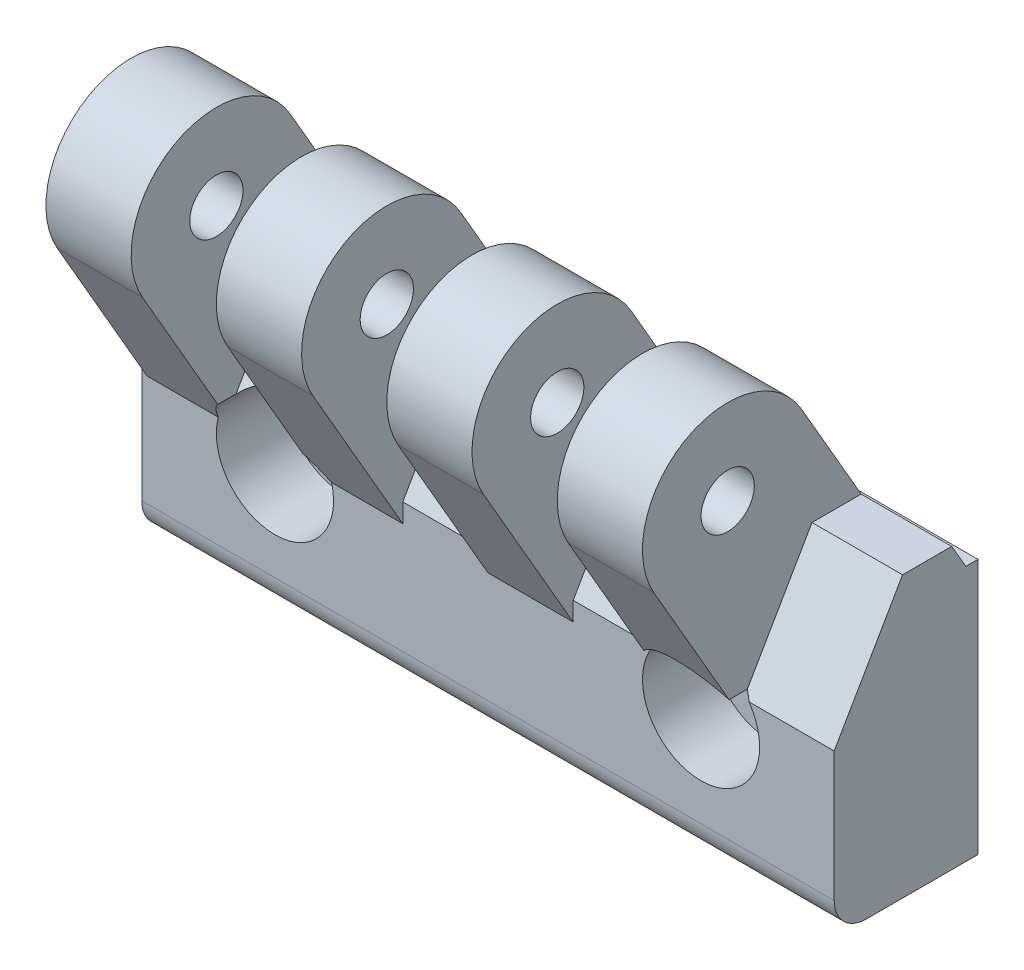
ISO-10303-21;
HEADER;
FILE_DESCRIPTION(('STEP AP214'),'2;1');
FILE_NAME('part.step','',(''),(''),'','','');
FILE_SCHEMA(('AUTOMOTIVE_DESIGN { 1 0 10303 214 1 1 1 1 }'));
ENDSEC;
DATA;
#1=APPLICATION_CONTEXT('core data for automotive mechanical design processes');
#2=APPLICATION_PROTOCOL_DEFINITION('international standard','automotive_design',2000,#1);
#3=PRODUCT_CONTEXT('',#1,'mechanical');
#4=PRODUCT('Part','Part','',(#3));
#5=PRODUCT_RELATED_PRODUCT_CATEGORY('part','',(#4));
#6=PRODUCT_DEFINITION_FORMATION('','',#4);
#7=PRODUCT_DEFINITION_CONTEXT('part definition',#1,'design');
#8=PRODUCT_DEFINITION('design','',#6,#7);
#9=PRODUCT_DEFINITION_SHAPE('','',#8);
#10=(LENGTH_UNIT() NAMED_UNIT(*) SI_UNIT(.MILLI.,.METRE.));
#11=(NAMED_UNIT(*) PLANE_ANGLE_UNIT() SI_UNIT($,.RADIAN.));
#12=(NAMED_UNIT(*) SI_UNIT($,.STERADIAN.) SOLID_ANGLE_UNIT());
#13=UNCERTAINTY_MEASURE_WITH_UNIT(LENGTH_MEASURE(1.E-05),#10,'distance_accuracy_value','');
#14=(GEOMETRIC_REPRESENTATION_CONTEXT(3) GLOBAL_UNCERTAINTY_ASSIGNED_CONTEXT((#13)) GLOBAL_UNIT_ASSIGNED_CONTEXT((#10,
#11,#12)) REPRESENTATION_CONTEXT('',''));
#15=CARTESIAN_POINT('',(0.,0.,0.));
#16=DIRECTION('',(0.,0.,1.));
#17=DIRECTION('',(1.,0.,0.));
#18=AXIS2_PLACEMENT_3D('',#15,#16,#17);
#19=CARTESIAN_POINT('',(4.,19.9999998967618,14.9999999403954));
#20=DIRECTION('',(1.,0.,0.));
#21=DIRECTION('',(0.,1.,0.));
#22=AXIS2_PLACEMENT_3D('',#19,#20,#21);
#23=PLANE('',#22);
#24=CARTESIAN_POINT('',(4.,20.,15.));
#25=DIRECTION('',(1.,0.,0.));
#26=DIRECTION('',(0.,1.,0.));
#27=AXIS2_PLACEMENT_3D('',#24,#25,#26);
#28=CIRCLE('',#27,2.5);
#29=CARTESIAN_POINT('',(4.,22.5,15.));
#30=VERTEX_POINT('',#29);
#31=EDGE_CURVE('E288',#30,#30,#28,.T.);
#32=ORIENTED_EDGE('',*,*,#31,.T.);
#33=EDGE_LOOP('',(#32));
#34=FACE_BOUND('',#33,.T.);
#35=DIRECTION('',(0.,0.,-1.));
#36=VECTOR('',#35,1.);
#37=CARTESIAN_POINT('',(4.,3.7749172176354,0.));
#38=LINE('',#37,#36);
#39=CARTESIAN_POINT('',(4.,3.7749172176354,14.8700483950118));
#40=VERTEX_POINT('',#39);
#41=CARTESIAN_POINT('',(4.,3.77491721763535,13.1504649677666));
#42=VERTEX_POINT('',#41);
#43=EDGE_CURVE('E604',#40,#42,#38,.T.);
#44=ORIENTED_EDGE('',*,*,#43,.F.);
#45=DIRECTION('',(0.,-0.866025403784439,-0.5));
#46=VECTOR('',#45,1.);
#47=CARTESIAN_POINT('',(4.,16.,21.9282032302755));
#48=LINE('',#47,#46);
#49=CARTESIAN_POINT('',(4.,16.,21.9282032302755));
#50=VERTEX_POINT('',#49);
#51=EDGE_CURVE('E285',#50,#40,#48,.T.);
#52=ORIENTED_EDGE('',*,*,#51,.F.);
#53=CARTESIAN_POINT('',(4.,19.9999998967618,14.9999999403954));
#54=DIRECTION('',(1.,0.,0.));
#55=DIRECTION('',(0.,1.,0.));
#56=AXIS2_PLACEMENT_3D('',#53,#54,#55);
#57=CIRCLE('',#56,8.);
#58=CARTESIAN_POINT('',(4.,24.,8.07179676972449));
#59=VERTEX_POINT('',#58);
#60=EDGE_CURVE('E281',#59,#50,#57,.T.);
#61=ORIENTED_EDGE('',*,*,#60,.F.);
#62=DIRECTION('',(0.,0.866025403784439,0.5));
#63=VECTOR('',#62,1.);
#64=CARTESIAN_POINT('',(4.,11.7512886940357,1.));
#65=LINE('',#64,#63);
#66=CARTESIAN_POINT('',(4.,14.2857142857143,2.4632512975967));
#67=VERTEX_POINT('',#66);
#68=EDGE_CURVE('E279',#67,#59,#65,.T.);
#69=ORIENTED_EDGE('',*,*,#68,.F.);
#70=DIRECTION('',(0.,0.,1.));
#71=VECTOR('',#70,1.);
#72=CARTESIAN_POINT('',(4.,14.2857142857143,2.4632512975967));
#73=LINE('',#72,#71);
#74=CARTESIAN_POINT('',(4.,14.2857142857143,7.08205345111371));
#75=VERTEX_POINT('',#74);
#76=EDGE_CURVE('E313',#67,#75,#73,.T.);
#77=ORIENTED_EDGE('',*,*,#76,.T.);
#78=DIRECTION('',(0.,-0.866025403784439,0.5));
#79=VECTOR('',#78,1.);
#80=CARTESIAN_POINT('',(4.,14.2857142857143,7.08205345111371));
#81=LINE('',#80,#79);
#82=EDGE_CURVE('E310',#75,#42,#81,.T.);
#83=ORIENTED_EDGE('',*,*,#82,.T.);
#84=EDGE_LOOP('',(#44,#52,#61,#69,#77,#83));
#85=FACE_BOUND('',#84,.T.);
#86=ADVANCED_FACE('F14',(#34,#85),#23,.F.);
#87=CARTESIAN_POINT('',(-4.,19.9999998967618,14.9999999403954));
#88=DIRECTION('',(1.,0.,0.));
#89=DIRECTION('',(0.,1.,0.));
#90=AXIS2_PLACEMENT_3D('',#87,#88,#89);
#91=PLANE('',#90);
#92=CARTESIAN_POINT('',(-4.,20.,15.));
#93=DIRECTION('',(1.,0.,0.));
#94=DIRECTION('',(0.,1.,0.));
#95=AXIS2_PLACEMENT_3D('',#92,#93,#94);
#96=CIRCLE('',#95,2.5);
#97=CARTESIAN_POINT('',(-4.,22.5,15.));
#98=VERTEX_POINT('',#97);
#99=EDGE_CURVE('E251',#98,#98,#96,.T.);
#100=ORIENTED_EDGE('',*,*,#99,.F.);
#101=EDGE_LOOP('',(#100));
#102=FACE_BOUND('',#101,.T.);
#103=DIRECTION('',(0.,-0.866025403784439,-0.5));
#104=VECTOR('',#103,1.);
#105=CARTESIAN_POINT('',(-4.,16.,21.9282032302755));
#106=LINE('',#105,#104);
#107=CARTESIAN_POINT('',(-4.,16.,21.9282032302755));
#108=VERTEX_POINT('',#107);
#109=CARTESIAN_POINT('',(-4.,3.7749172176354,14.8700483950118));
#110=VERTEX_POINT('',#109);
#111=EDGE_CURVE('E242',#108,#110,#106,.T.);
#112=ORIENTED_EDGE('',*,*,#111,.T.);
#113=DIRECTION('',(0.,0.,-1.));
#114=VECTOR('',#113,1.);
#115=CARTESIAN_POINT('',(-4.,3.7749172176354,0.));
#116=LINE('',#115,#114);
#117=CARTESIAN_POINT('',(-4.,3.77491721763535,13.1504649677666));
#118=VERTEX_POINT('',#117);
#119=EDGE_CURVE('E9',#110,#118,#116,.T.);
#120=ORIENTED_EDGE('',*,*,#119,.T.);
#121=DIRECTION('',(0.,-0.866025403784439,0.5));
#122=VECTOR('',#121,1.);
#123=CARTESIAN_POINT('',(-4.,14.2857142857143,7.08205345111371));
#124=LINE('',#123,#122);
#125=CARTESIAN_POINT('',(-4.,14.2857142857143,7.08205345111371));
#126=VERTEX_POINT('',#125);
#127=EDGE_CURVE('E266',#126,#118,#124,.T.);
#128=ORIENTED_EDGE('',*,*,#127,.F.);
#129=DIRECTION('',(0.,0.,1.));
#130=VECTOR('',#129,1.);
#131=CARTESIAN_POINT('',(-4.,14.2857142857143,2.4632512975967));
#132=LINE('',#131,#130);
#133=CARTESIAN_POINT('',(-4.,14.2857142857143,2.4632512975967));
#134=VERTEX_POINT('',#133);
#135=EDGE_CURVE('E268',#134,#126,#132,.T.);
#136=ORIENTED_EDGE('',*,*,#135,.F.);
#137=DIRECTION('',(0.,0.866025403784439,0.5));
#138=VECTOR('',#137,1.);
#139=CARTESIAN_POINT('',(-4.,11.7512886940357,1.));
#140=LINE('',#139,#138);
#141=CARTESIAN_POINT('',(-4.,24.,8.07179676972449));
#142=VERTEX_POINT('',#141);
#143=EDGE_CURVE('E256',#134,#142,#140,.T.);
#144=ORIENTED_EDGE('',*,*,#143,.T.);
#145=CARTESIAN_POINT('',(-4.,19.9999998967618,14.9999999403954));
#146=DIRECTION('',(1.,0.,0.));
#147=DIRECTION('',(0.,1.,0.));
#148=AXIS2_PLACEMENT_3D('',#145,#146,#147);
#149=CIRCLE('',#148,8.);
#150=EDGE_CURVE('E250',#142,#108,#149,.T.);
#151=ORIENTED_EDGE('',*,*,#150,.T.);
#152=EDGE_LOOP('',(#112,#120,#128,#136,#144,#151));
#153=FACE_BOUND('',#152,.T.);
#154=ADVANCED_FACE('F248',(#102,#153),#91,.T.);
#155=CARTESIAN_POINT('',(44.,19.9999998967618,14.9999999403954));
#156=DIRECTION('',(1.,0.,0.));
#157=DIRECTION('',(0.,1.,0.));
#158=AXIS2_PLACEMENT_3D('',#155,#156,#157);
#159=PLANE('',#158);
#160=CARTESIAN_POINT('',(44.,20.,15.));
#161=DIRECTION('',(1.,0.,0.));
#162=DIRECTION('',(0.,1.,0.));
#163=AXIS2_PLACEMENT_3D('',#160,#161,#162);
#164=CIRCLE('',#163,2.5);
#165=CARTESIAN_POINT('',(44.,22.5,15.));
#166=VERTEX_POINT('',#165);
#167=EDGE_CURVE('E569',#166,#166,#164,.T.);
#168=ORIENTED_EDGE('',*,*,#167,.F.);
#169=EDGE_LOOP('',(#168));
#170=FACE_BOUND('',#169,.T.);
#171=DIRECTION('',(0.,-0.866025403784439,-0.5));
#172=VECTOR('',#171,1.);
#173=CARTESIAN_POINT('',(44.,16.,21.9282032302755));
#174=LINE('',#173,#172);
#175=CARTESIAN_POINT('',(44.,16.,21.9282032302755));
#176=VERTEX_POINT('',#175);
#177=CARTESIAN_POINT('',(44.,3.77491721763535,14.8700483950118));
#178=VERTEX_POINT('',#177);
#179=EDGE_CURVE('E566',#176,#178,#174,.T.);
#180=ORIENTED_EDGE('',*,*,#179,.T.);
#181=DIRECTION('',(0.,0.,-1.));
#182=VECTOR('',#181,1.);
#183=CARTESIAN_POINT('',(44.,3.77491721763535,0.));
#184=LINE('',#183,#182);
#185=CARTESIAN_POINT('',(44.,3.77491721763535,13.1504649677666));
#186=VERTEX_POINT('',#185);
#187=EDGE_CURVE('E453',#178,#186,#184,.T.);
#188=ORIENTED_EDGE('',*,*,#187,.T.);
#189=DIRECTION('',(0.,-0.866025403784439,0.5));
#190=VECTOR('',#189,1.);
#191=CARTESIAN_POINT('',(44.,14.2857142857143,7.08205345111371));
#192=LINE('',#191,#190);
#193=CARTESIAN_POINT('',(44.,14.2857142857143,7.08205345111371));
#194=VERTEX_POINT('',#193);
#195=EDGE_CURVE('E440',#194,#186,#192,.T.);
#196=ORIENTED_EDGE('',*,*,#195,.F.);
#197=DIRECTION('',(0.,0.,1.));
#198=VECTOR('',#197,1.);
#199=CARTESIAN_POINT('',(44.,14.2857142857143,2.4632512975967));
#200=LINE('',#199,#198);
#201=CARTESIAN_POINT('',(44.,14.2857142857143,2.4632512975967));
#202=VERTEX_POINT('',#201);
#203=EDGE_CURVE('E463',#202,#194,#200,.T.);
#204=ORIENTED_EDGE('',*,*,#203,.F.);
#205=DIRECTION('',(0.,0.866025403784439,0.5));
#206=VECTOR('',#205,1.);
#207=CARTESIAN_POINT('',(44.,11.7512886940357,1.));
#208=LINE('',#207,#206);
#209=CARTESIAN_POINT('',(44.,24.,8.07179676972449));
#210=VERTEX_POINT('',#209);
#211=EDGE_CURVE('E561',#202,#210,#208,.T.);
#212=ORIENTED_EDGE('',*,*,#211,.T.);
#213=CARTESIAN_POINT('',(44.,19.9999998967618,14.9999999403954));
#214=DIRECTION('',(1.,0.,0.));
#215=DIRECTION('',(0.,1.,0.));
#216=AXIS2_PLACEMENT_3D('',#213,#214,#215);
#217=CIRCLE('',#216,8.);
#218=EDGE_CURVE('E563',#210,#176,#217,.T.);
#219=ORIENTED_EDGE('',*,*,#218,.T.);
#220=EDGE_LOOP('',(#180,#188,#196,#204,#212,#219));
#221=FACE_BOUND('',#220,.T.);
#222=ADVANCED_FACE('F637',(#170,#221),#159,.T.);
#223=CARTESIAN_POINT('',(36.,19.9999998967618,14.9999999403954));
#224=DIRECTION('',(1.,0.,0.));
#225=DIRECTION('',(0.,1.,0.));
#226=AXIS2_PLACEMENT_3D('',#223,#224,#225);
#227=PLANE('',#226);
#228=CARTESIAN_POINT('',(36.,20.,15.));
#229=DIRECTION('',(1.,0.,0.));
#230=DIRECTION('',(0.,1.,0.));
#231=AXIS2_PLACEMENT_3D('',#228,#229,#230);
#232=CIRCLE('',#231,2.5);
#233=CARTESIAN_POINT('',(36.,22.5,15.));
#234=VERTEX_POINT('',#233);
#235=EDGE_CURVE('E564',#234,#234,#232,.T.);
#236=ORIENTED_EDGE('',*,*,#235,.T.);
#237=EDGE_LOOP('',(#236));
#238=FACE_BOUND('',#237,.T.);
#239=DIRECTION('',(0.,0.,-1.));
#240=VECTOR('',#239,1.);
#241=CARTESIAN_POINT('',(36.,3.77491721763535,0.));
#242=LINE('',#241,#240);
#243=CARTESIAN_POINT('',(36.,3.77491721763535,14.8700483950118));
#244=VERTEX_POINT('',#243);
#245=CARTESIAN_POINT('',(36.,3.77491721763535,13.1504649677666));
#246=VERTEX_POINT('',#245);
#247=EDGE_CURVE('E22',#244,#246,#242,.T.);
#248=ORIENTED_EDGE('',*,*,#247,.F.);
#249=DIRECTION('',(0.,-0.866025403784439,-0.5));
#250=VECTOR('',#249,1.);
#251=CARTESIAN_POINT('',(36.,16.,21.9282032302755));
#252=LINE('',#251,#250);
#253=CARTESIAN_POINT('',(36.,16.,21.9282032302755));
#254=VERTEX_POINT('',#253);
#255=EDGE_CURVE('E575',#254,#244,#252,.T.);
#256=ORIENTED_EDGE('',*,*,#255,.F.);
#257=CARTESIAN_POINT('',(36.,19.9999998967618,14.9999999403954));
#258=DIRECTION('',(1.,0.,0.));
#259=DIRECTION('',(0.,1.,0.));
#260=AXIS2_PLACEMENT_3D('',#257,#258,#259);
#261=CIRCLE('',#260,8.);
#262=CARTESIAN_POINT('',(36.,24.,8.07179676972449));
#263=VERTEX_POINT('',#262);
#264=EDGE_CURVE('E573',#263,#254,#261,.T.);
#265=ORIENTED_EDGE('',*,*,#264,.F.);
#266=DIRECTION('',(0.,0.866025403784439,0.5));
#267=VECTOR('',#266,1.);
#268=CARTESIAN_POINT('',(36.,11.7512886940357,1.));
#269=LINE('',#268,#267);
#270=CARTESIAN_POINT('',(36.,14.2857142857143,2.4632512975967));
#271=VERTEX_POINT('',#270);
#272=EDGE_CURVE('E460',#271,#263,#269,.T.);
#273=ORIENTED_EDGE('',*,*,#272,.F.);
#274=DIRECTION('',(0.,0.,1.));
#275=VECTOR('',#274,1.);
#276=CARTESIAN_POINT('',(36.,14.2857142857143,2.4632512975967));
#277=LINE('',#276,#275);
#278=CARTESIAN_POINT('',(36.,14.2857142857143,7.08205345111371));
#279=VERTEX_POINT('',#278);
#280=EDGE_CURVE('E458',#271,#279,#277,.T.);
#281=ORIENTED_EDGE('',*,*,#280,.T.);
#282=DIRECTION('',(0.,-0.866025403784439,0.5));
#283=VECTOR('',#282,1.);
#284=CARTESIAN_POINT('',(36.,14.2857142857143,7.08205345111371));
#285=LINE('',#284,#283);
#286=EDGE_CURVE('E437',#279,#246,#285,.T.);
#287=ORIENTED_EDGE('',*,*,#286,.T.);
#288=EDGE_LOOP('',(#248,#256,#265,#273,#281,#287));
#289=FACE_BOUND('',#288,.T.);
#290=ADVANCED_FACE('F456',(#238,#289),#227,.F.);
#291=CARTESIAN_POINT('',(52.5,14.2857142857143,2.4632512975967));
#292=DIRECTION('',(0.,-1.,0.));
#293=DIRECTION('',(1.,0.,0.));
#294=AXIS2_PLACEMENT_3D('',#291,#292,#293);
#295=PLANE('',#294);
#296=ORIENTED_EDGE('',*,*,#280,.F.);
#297=DIRECTION('',(-1.,0.,0.));
#298=VECTOR('',#297,1.);
#299=CARTESIAN_POINT('',(52.5,14.2857142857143,2.4632512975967));
#300=LINE('',#299,#298);
#301=CARTESIAN_POINT('',(28.,14.2857142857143,2.4632512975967));
#302=VERTEX_POINT('',#301);
#303=EDGE_CURVE('E410',#271,#302,#300,.T.);
#304=ORIENTED_EDGE('',*,*,#303,.T.);
#305=DIRECTION('',(0.,0.,1.));
#306=VECTOR('',#305,1.);
#307=CARTESIAN_POINT('',(28.,14.2857142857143,2.4632512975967));
#308=LINE('',#307,#306);
#309=CARTESIAN_POINT('',(28.,14.2857142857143,7.08205345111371));
#310=VERTEX_POINT('',#309);
#311=EDGE_CURVE('E350',#302,#310,#308,.T.);
#312=ORIENTED_EDGE('',*,*,#311,.T.);
#313=DIRECTION('',(-1.,0.,0.));
#314=VECTOR('',#313,1.);
#315=CARTESIAN_POINT('',(52.5,14.2857142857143,7.08205345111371));
#316=LINE('',#315,#314);
#317=EDGE_CURVE('E405',#279,#310,#316,.T.);
#318=ORIENTED_EDGE('',*,*,#317,.F.);
#319=EDGE_LOOP('',(#296,#304,#312,#318));
#320=FACE_BOUND('',#319,.T.);
#321=ADVANCED_FACE('F675',(#320),#295,.F.);
#322=CARTESIAN_POINT('',(52.5,14.2857142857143,7.08205345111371));
#323=DIRECTION('',(0.,-0.5,-0.866025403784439));
#324=DIRECTION('',(0.,0.866025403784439,-0.5));
#325=AXIS2_PLACEMENT_3D('',#322,#323,#324);
#326=PLANE('',#325);
#327=CARTESIAN_POINT('',(40.,0.,15.3299144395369));
#328=DIRECTION('',(0.,-0.5,-0.866025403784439));
#329=DIRECTION('',(0.,0.866025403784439,-0.5));
#330=AXIS2_PLACEMENT_3D('',#327,#328,#329);
#331=ELLIPSE('',#330,6.35085296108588,5.5);
#332=CARTESIAN_POINT('',(35.5050873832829,3.1695047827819,13.5));
#333=VERTEX_POINT('',#332);
#334=EDGE_CURVE('E445',#246,#333,#331,.F.);
#335=ORIENTED_EDGE('',*,*,#334,.F.);
#336=ORIENTED_EDGE('',*,*,#286,.F.);
#337=ORIENTED_EDGE('',*,*,#317,.T.);
#338=DIRECTION('',(0.,-0.866025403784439,0.5));
#339=VECTOR('',#338,1.);
#340=CARTESIAN_POINT('',(28.,14.2857142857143,7.08205345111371));
#341=LINE('',#340,#339);
#342=CARTESIAN_POINT('',(28.,3.1695047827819,13.5));
#343=VERTEX_POINT('',#342);
#344=EDGE_CURVE('E347',#310,#343,#341,.T.);
#345=ORIENTED_EDGE('',*,*,#344,.T.);
#346=DIRECTION('',(-1.,0.,0.));
#347=VECTOR('',#346,1.);
#348=CARTESIAN_POINT('',(52.5,3.1695047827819,13.5));
#349=LINE('',#348,#347);
#350=EDGE_CURVE('E399',#333,#343,#349,.T.);
#351=ORIENTED_EDGE('',*,*,#350,.F.);
#352=EDGE_LOOP('',(#335,#336,#337,#345,#351));
#353=FACE_BOUND('',#352,.T.);
#354=ADVANCED_FACE('F451',(#353),#326,.F.);
#355=DIRECTION('',(0.,0.,1.));
#356=VECTOR('',#355,1.);
#357=CARTESIAN_POINT('',(-12.,14.2857142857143,2.4632512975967));
#358=LINE('',#357,#356);
#359=CARTESIAN_POINT('',(-12.,14.2857142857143,2.4632512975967));
#360=VERTEX_POINT('',#359);
#361=CARTESIAN_POINT('',(-12.,14.2857142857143,7.08205345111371));
#362=VERTEX_POINT('',#361);
#363=EDGE_CURVE('E276',#360,#362,#358,.T.);
#364=ORIENTED_EDGE('',*,*,#363,.F.);
#365=CARTESIAN_POINT('',(-12.5,14.2857142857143,2.4632512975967));
#366=VERTEX_POINT('',#365);
#367=EDGE_CURVE('E404',#360,#366,#300,.T.);
#368=ORIENTED_EDGE('',*,*,#367,.T.);
#369=DIRECTION('',(0.,0.,1.));
#370=VECTOR('',#369,1.);
#371=CARTESIAN_POINT('',(-12.5,14.2857142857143,2.4632512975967));
#372=LINE('',#371,#370);
#373=CARTESIAN_POINT('',(-12.5,14.2857142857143,7.08205345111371));
#374=VERTEX_POINT('',#373);
#375=EDGE_CURVE('E385',#366,#374,#372,.T.);
#376=ORIENTED_EDGE('',*,*,#375,.T.);
#377=EDGE_CURVE('E398',#362,#374,#316,.T.);
#378=ORIENTED_EDGE('',*,*,#377,.F.);
#379=EDGE_LOOP('',(#364,#368,#376,#378));
#380=FACE_BOUND('',#379,.T.);
#381=ADVANCED_FACE('F536',(#380),#295,.F.);
#382=DIRECTION('',(0.,-0.866025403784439,0.5));
#383=VECTOR('',#382,1.);
#384=CARTESIAN_POINT('',(-12.,14.2857142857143,7.08205345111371));
#385=LINE('',#384,#383);
#386=CARTESIAN_POINT('',(-12.,3.1695047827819,13.5));
#387=VERTEX_POINT('',#386);
#388=EDGE_CURVE('E274',#362,#387,#385,.T.);
#389=ORIENTED_EDGE('',*,*,#388,.F.);
#390=ORIENTED_EDGE('',*,*,#377,.T.);
#391=DIRECTION('',(0.,-0.866025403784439,0.5));
#392=VECTOR('',#391,1.);
#393=CARTESIAN_POINT('',(-12.5,14.2857142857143,7.08205345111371));
#394=LINE('',#393,#392);
#395=CARTESIAN_POINT('',(-12.5,3.1695047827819,13.5));
#396=VERTEX_POINT('',#395);
#397=EDGE_CURVE('E388',#374,#396,#394,.T.);
#398=ORIENTED_EDGE('',*,*,#397,.T.);
#399=EDGE_CURVE('E394',#387,#396,#349,.T.);
#400=ORIENTED_EDGE('',*,*,#399,.F.);
#401=EDGE_LOOP('',(#389,#390,#398,#400));
#402=FACE_BOUND('',#401,.T.);
#403=ADVANCED_FACE('F498',(#402),#326,.F.);
#404=CARTESIAN_POINT('',(52.5,3.1695047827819,13.5));
#405=DIRECTION('',(0.,0.,-1.));
#406=DIRECTION('',(-1.,0.,0.));
#407=AXIS2_PLACEMENT_3D('',#404,#405,#406);
#408=PLANE('',#407);
#409=DIRECTION('',(-1.,0.,0.));
#410=VECTOR('',#409,1.);
#411=CARTESIAN_POINT('',(52.5,1.4019237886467,13.5));
#412=LINE('',#411,#410);
#413=CARTESIAN_POINT('',(12.,1.4019237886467,13.5));
#414=VERTEX_POINT('',#413);
#415=CARTESIAN_POINT('',(5.3183277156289,1.4019237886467,13.5));
#416=VERTEX_POINT('',#415);
#417=EDGE_CURVE('E433',#414,#416,#412,.T.);
#418=ORIENTED_EDGE('',*,*,#417,.T.);
#419=CARTESIAN_POINT('',(0.,0.,13.5));
#420=DIRECTION('',(0.,0.,-1.));
#421=DIRECTION('',(-1.,0.,0.));
#422=AXIS2_PLACEMENT_3D('',#419,#420,#421);
#423=CIRCLE('',#422,5.5);
#424=CARTESIAN_POINT('',(-5.3183277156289,1.4019237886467,13.5));
#425=VERTEX_POINT('',#424);
#426=EDGE_CURVE('E717',#425,#416,#423,.F.);
#427=ORIENTED_EDGE('',*,*,#426,.F.);
#428=DIRECTION('',(-1.,0.,0.));
#429=VECTOR('',#428,1.);
#430=CARTESIAN_POINT('',(52.5,1.4019237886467,13.5));
#431=LINE('',#430,#429);
#432=CARTESIAN_POINT('',(-12.,1.4019237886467,13.5));
#433=VERTEX_POINT('',#432);
#434=EDGE_CURVE('E245',#425,#433,#431,.T.);
#435=ORIENTED_EDGE('',*,*,#434,.T.);
#436=DIRECTION('',(0.,-1.,0.));
#437=VECTOR('',#436,1.);
#438=CARTESIAN_POINT('',(-12.,3.1695047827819,13.5));
#439=LINE('',#438,#437);
#440=EDGE_CURVE('E271',#387,#433,#439,.T.);
#441=ORIENTED_EDGE('',*,*,#440,.F.);
#442=ORIENTED_EDGE('',*,*,#399,.T.);
#443=DIRECTION('',(0.,-1.,0.));
#444=VECTOR('',#443,1.);
#445=CARTESIAN_POINT('',(-12.5,3.1695047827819,13.5));
#446=LINE('',#445,#444);
#447=CARTESIAN_POINT('',(-12.5,-9.,13.5));
#448=VERTEX_POINT('',#447);
#449=EDGE_CURVE('E358',#396,#448,#446,.T.);
#450=ORIENTED_EDGE('',*,*,#449,.T.);
#451=DIRECTION('',(-1.,0.,0.));
#452=VECTOR('',#451,1.);
#453=CARTESIAN_POINT('',(52.5,-9.,13.5));
#454=LINE('',#453,#452);
#455=CARTESIAN_POINT('',(52.5,-9.,13.5));
#456=VERTEX_POINT('',#455);
#457=EDGE_CURVE('E372',#456,#448,#454,.T.);
#458=ORIENTED_EDGE('',*,*,#457,.F.);
#459=DIRECTION('',(0.,-1.,0.));
#460=VECTOR('',#459,1.);
#461=CARTESIAN_POINT('',(52.5,3.1695047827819,13.5));
#462=LINE('',#461,#460);
#463=CARTESIAN_POINT('',(52.5,3.1695047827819,13.5));
#464=VERTEX_POINT('',#463);
#465=EDGE_CURVE('E370',#464,#456,#462,.T.);
#466=ORIENTED_EDGE('',*,*,#465,.F.);
#467=CARTESIAN_POINT('',(44.4949126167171,3.1695047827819,13.5));
#468=VERTEX_POINT('',#467);
#469=EDGE_CURVE('E395',#464,#468,#349,.T.);
#470=ORIENTED_EDGE('',*,*,#469,.T.);
#471=CARTESIAN_POINT('',(40.,0.,13.5));
#472=DIRECTION('',(0.,0.,-1.));
#473=DIRECTION('',(-1.,0.,0.));
#474=AXIS2_PLACEMENT_3D('',#471,#472,#473);
#475=CIRCLE('',#474,5.5);
#476=EDGE_CURVE('E504',#333,#468,#475,.F.);
#477=ORIENTED_EDGE('',*,*,#476,.F.);
#478=ORIENTED_EDGE('',*,*,#350,.T.);
#479=DIRECTION('',(0.,-1.,0.));
#480=VECTOR('',#479,1.);
#481=CARTESIAN_POINT('',(28.,3.1695047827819,13.5));
#482=LINE('',#481,#480);
#483=CARTESIAN_POINT('',(28.,1.4019237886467,13.5));
#484=VERTEX_POINT('',#483);
#485=EDGE_CURVE('E428',#343,#484,#482,.T.);
#486=ORIENTED_EDGE('',*,*,#485,.T.);
#487=DIRECTION('',(1.,0.,0.));
#488=VECTOR('',#487,1.);
#489=CARTESIAN_POINT('',(52.5,1.4019237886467,13.5));
#490=LINE('',#489,#488);
#491=CARTESIAN_POINT('',(20.,1.4019237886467,13.5));
#492=VERTEX_POINT('',#491);
#493=EDGE_CURVE('E425',#492,#484,#490,.T.);
#494=ORIENTED_EDGE('',*,*,#493,.F.);
#495=DIRECTION('',(0.,-1.,0.));
#496=VECTOR('',#495,1.);
#497=CARTESIAN_POINT('',(20.,3.1695047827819,13.5));
#498=LINE('',#497,#496);
#499=CARTESIAN_POINT('',(20.,3.1695047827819,13.5));
#500=VERTEX_POINT('',#499);
#501=EDGE_CURVE('E422',#500,#492,#498,.T.);
#502=ORIENTED_EDGE('',*,*,#501,.F.);
#503=CARTESIAN_POINT('',(12.,3.1695047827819,13.5));
#504=VERTEX_POINT('',#503);
#505=EDGE_CURVE('E400',#500,#504,#349,.T.);
#506=ORIENTED_EDGE('',*,*,#505,.T.);
#507=DIRECTION('',(0.,-1.,0.));
#508=VECTOR('',#507,1.);
#509=CARTESIAN_POINT('',(12.,3.1695047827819,13.5));
#510=LINE('',#509,#508);
#511=EDGE_CURVE('E430',#504,#414,#510,.T.);
#512=ORIENTED_EDGE('',*,*,#511,.T.);
#513=EDGE_LOOP('',(#418,#427,#435,#441,#442,#450,#458,#466,#470,#477,#478,#486,#494,#502,#506,#512));
#514=FACE_BOUND('',#513,.T.);
#515=ADVANCED_FACE('F496',(#514),#408,.F.);
#516=EDGE_CURVE('E591',#67,#134,#300,.T.);
#517=ORIENTED_EDGE('',*,*,#516,.T.);
#518=ORIENTED_EDGE('',*,*,#135,.T.);
#519=EDGE_CURVE('E528',#75,#126,#316,.T.);
#520=ORIENTED_EDGE('',*,*,#519,.F.);
#521=ORIENTED_EDGE('',*,*,#76,.F.);
#522=EDGE_LOOP('',(#517,#518,#520,#521));
#523=FACE_BOUND('',#522,.T.);
#524=ADVANCED_FACE('F594',(#523),#295,.F.);
#525=CARTESIAN_POINT('',(0.,0.,15.3299144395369));
#526=DIRECTION('',(0.,-0.5,-0.866025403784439));
#527=DIRECTION('',(0.,0.866025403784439,-0.5));
#528=AXIS2_PLACEMENT_3D('',#525,#526,#527);
#529=ELLIPSE('',#528,6.35085296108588,5.5);
#530=EDGE_CURVE('E29',#42,#118,#529,.F.);
#531=ORIENTED_EDGE('',*,*,#530,.F.);
#532=ORIENTED_EDGE('',*,*,#82,.F.);
#533=ORIENTED_EDGE('',*,*,#519,.T.);
#534=ORIENTED_EDGE('',*,*,#127,.T.);
#535=EDGE_LOOP('',(#531,#532,#533,#534));
#536=FACE_BOUND('',#535,.T.);
#537=ADVANCED_FACE('F858',(#536),#326,.F.);
#538=CARTESIAN_POINT('',(20.,14.2857142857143,2.4632512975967));
#539=VERTEX_POINT('',#538);
#540=CARTESIAN_POINT('',(12.,14.2857142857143,2.4632512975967));
#541=VERTEX_POINT('',#540);
#542=EDGE_CURVE('E411',#539,#541,#300,.T.);
#543=ORIENTED_EDGE('',*,*,#542,.T.);
#544=DIRECTION('',(0.,0.,1.));
#545=VECTOR('',#544,1.);
#546=CARTESIAN_POINT('',(12.,14.2857142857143,2.4632512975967));
#547=LINE('',#546,#545);
#548=CARTESIAN_POINT('',(12.,14.2857142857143,7.08205345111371));
#549=VERTEX_POINT('',#548);
#550=EDGE_CURVE('E307',#541,#549,#547,.T.);
#551=ORIENTED_EDGE('',*,*,#550,.T.);
#552=CARTESIAN_POINT('',(20.,14.2857142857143,7.08205345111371));
#553=VERTEX_POINT('',#552);
#554=EDGE_CURVE('E406',#553,#549,#316,.T.);
#555=ORIENTED_EDGE('',*,*,#554,.F.);
#556=DIRECTION('',(0.,0.,1.));
#557=VECTOR('',#556,1.);
#558=CARTESIAN_POINT('',(20.,14.2857142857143,2.4632512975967));
#559=LINE('',#558,#557);
#560=EDGE_CURVE('E344',#539,#553,#559,.T.);
#561=ORIENTED_EDGE('',*,*,#560,.F.);
#562=EDGE_LOOP('',(#543,#551,#555,#561));
#563=FACE_BOUND('',#562,.T.);
#564=ADVANCED_FACE('F526',(#563),#295,.F.);
#565=ORIENTED_EDGE('',*,*,#554,.T.);
#566=DIRECTION('',(0.,-0.866025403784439,0.5));
#567=VECTOR('',#566,1.);
#568=CARTESIAN_POINT('',(12.,14.2857142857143,7.08205345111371));
#569=LINE('',#568,#567);
#570=EDGE_CURVE('E304',#549,#504,#569,.T.);
#571=ORIENTED_EDGE('',*,*,#570,.T.);
#572=ORIENTED_EDGE('',*,*,#505,.F.);
#573=DIRECTION('',(0.,-0.866025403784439,0.5));
#574=VECTOR('',#573,1.);
#575=CARTESIAN_POINT('',(20.,14.2857142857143,7.08205345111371));
#576=LINE('',#575,#574);
#577=EDGE_CURVE('E341',#553,#500,#576,.T.);
#578=ORIENTED_EDGE('',*,*,#577,.F.);
#579=EDGE_LOOP('',(#565,#571,#572,#578));
#580=FACE_BOUND('',#579,.T.);
#581=ADVANCED_FACE('F523',(#580),#326,.F.);
#582=CARTESIAN_POINT('',(52.5,-9.,10.5));
#583=DIRECTION('',(-1.,0.,0.));
#584=DIRECTION('',(0.,-1.,0.));
#585=AXIS2_PLACEMENT_3D('',#582,#583,#584);
#586=CYLINDRICAL_SURFACE('',#585,3.);
#587=CARTESIAN_POINT('',(-12.5,-9.,10.5));
#588=DIRECTION('',(1.,0.,0.));
#589=DIRECTION('',(0.,1.,0.));
#590=AXIS2_PLACEMENT_3D('',#587,#588,#589);
#591=CIRCLE('',#590,3.);
#592=CARTESIAN_POINT('',(-12.5,-12.,10.5));
#593=VERTEX_POINT('',#592);
#594=EDGE_CURVE('E353',#448,#593,#591,.T.);
#595=ORIENTED_EDGE('',*,*,#594,.T.);
#596=DIRECTION('',(-1.,0.,0.));
#597=VECTOR('',#596,1.);
#598=CARTESIAN_POINT('',(52.5,-12.,10.5));
#599=LINE('',#598,#597);
#600=CARTESIAN_POINT('',(52.5,-12.,10.5));
#601=VERTEX_POINT('',#600);
#602=EDGE_CURVE('E419',#601,#593,#599,.T.);
#603=ORIENTED_EDGE('',*,*,#602,.F.);
#604=CARTESIAN_POINT('',(52.5,-9.,10.5));
#605=DIRECTION('',(1.,0.,0.));
#606=DIRECTION('',(0.,1.,0.));
#607=AXIS2_PLACEMENT_3D('',#604,#605,#606);
#608=CIRCLE('',#607,3.);
#609=EDGE_CURVE('E354',#456,#601,#608,.T.);
#610=ORIENTED_EDGE('',*,*,#609,.F.);
#611=ORIENTED_EDGE('',*,*,#457,.T.);
#612=EDGE_LOOP('',(#595,#603,#610,#611));
#613=FACE_BOUND('',#612,.T.);
#614=ADVANCED_FACE('F16',(#613),#586,.T.);
#615=CARTESIAN_POINT('',(52.5,-12.,10.5));
#616=DIRECTION('',(0.,1.,0.));
#617=DIRECTION('',(-1.,0.,0.));
#618=AXIS2_PLACEMENT_3D('',#615,#616,#617);
#619=PLANE('',#618);
#620=DIRECTION('',(0.,0.,-1.));
#621=VECTOR('',#620,1.);
#622=CARTESIAN_POINT('',(-12.5,-12.,10.5));
#623=LINE('',#622,#621);
#624=CARTESIAN_POINT('',(-12.5,-12.,0.));
#625=VERTEX_POINT('',#624);
#626=EDGE_CURVE('E375',#593,#625,#623,.T.);
#627=ORIENTED_EDGE('',*,*,#626,.T.);
#628=DIRECTION('',(-1.,0.,0.));
#629=VECTOR('',#628,1.);
#630=CARTESIAN_POINT('',(52.5,-12.,0.));
#631=LINE('',#630,#629);
#632=CARTESIAN_POINT('',(52.5,-12.,0.));
#633=VERTEX_POINT('',#632);
#634=EDGE_CURVE('E416',#633,#625,#631,.T.);
#635=ORIENTED_EDGE('',*,*,#634,.F.);
#636=DIRECTION('',(0.,0.,-1.));
#637=VECTOR('',#636,1.);
#638=CARTESIAN_POINT('',(52.5,-12.,10.5));
#639=LINE('',#638,#637);
#640=EDGE_CURVE('E357',#601,#633,#639,.T.);
#641=ORIENTED_EDGE('',*,*,#640,.F.);
#642=ORIENTED_EDGE('',*,*,#602,.T.);
#643=EDGE_LOOP('',(#627,#635,#641,#642));
#644=FACE_BOUND('',#643,.T.);
#645=ADVANCED_FACE('F684',(#644),#619,.F.);
#646=CARTESIAN_POINT('',(52.5,-12.,0.));
#647=DIRECTION('',(0.,0.,1.));
#648=DIRECTION('',(1.,0.,0.));
#649=AXIS2_PLACEMENT_3D('',#646,#647,#648);
#650=PLANE('',#649);
#651=CARTESIAN_POINT('',(0.,0.,0.));
#652=DIRECTION('',(0.,0.,-1.));
#653=DIRECTION('',(-1.,0.,0.));
#654=AXIS2_PLACEMENT_3D('',#651,#652,#653);
#655=CIRCLE('',#654,3.25);
#656=CARTESIAN_POINT('',(-3.25,0.,0.));
#657=VERTEX_POINT('',#656);
#658=EDGE_CURVE('E725',#657,#657,#655,.T.);
#659=ORIENTED_EDGE('',*,*,#658,.F.);
#660=EDGE_LOOP('',(#659));
#661=FACE_BOUND('',#660,.T.);
#662=CARTESIAN_POINT('',(40.,0.,0.));
#663=DIRECTION('',(0.,0.,-1.));
#664=DIRECTION('',(-1.,0.,0.));
#665=AXIS2_PLACEMENT_3D('',#662,#663,#664);
#666=CIRCLE('',#665,3.25);
#667=CARTESIAN_POINT('',(36.75,0.,0.));
#668=VERTEX_POINT('',#667);
#669=EDGE_CURVE('E712',#668,#668,#666,.T.);
#670=ORIENTED_EDGE('',*,*,#669,.F.);
#671=EDGE_LOOP('',(#670));
#672=FACE_BOUND('',#671,.T.);
#673=DIRECTION('',(0.,1.,0.));
#674=VECTOR('',#673,1.);
#675=CARTESIAN_POINT('',(-12.5,-12.,0.));
#676=LINE('',#675,#674);
#677=CARTESIAN_POINT('',(-12.5,12.,0.));
#678=VERTEX_POINT('',#677);
#679=EDGE_CURVE('E377',#625,#678,#676,.T.);
#680=ORIENTED_EDGE('',*,*,#679,.T.);
#681=DIRECTION('',(-1.,0.,0.));
#682=VECTOR('',#681,1.);
#683=CARTESIAN_POINT('',(52.5,12.,0.));
#684=LINE('',#683,#682);
#685=CARTESIAN_POINT('',(52.5,12.,0.));
#686=VERTEX_POINT('',#685);
#687=EDGE_CURVE('E413',#686,#678,#684,.T.);
#688=ORIENTED_EDGE('',*,*,#687,.F.);
#689=DIRECTION('',(0.,1.,0.));
#690=VECTOR('',#689,1.);
#691=CARTESIAN_POINT('',(52.5,-12.,0.));
#692=LINE('',#691,#690);
#693=EDGE_CURVE('E360',#633,#686,#692,.T.);
#694=ORIENTED_EDGE('',*,*,#693,.F.);
#695=ORIENTED_EDGE('',*,*,#634,.T.);
#696=EDGE_LOOP('',(#680,#688,#694,#695));
#697=FACE_BOUND('',#696,.T.);
#698=ADVANCED_FACE('F681',(#661,#672,#697),#650,.F.);
#699=CARTESIAN_POINT('',(52.5,12.,0.));
#700=DIRECTION('',(0.,-1.,0.));
#701=DIRECTION('',(1.,0.,0.));
#702=AXIS2_PLACEMENT_3D('',#699,#700,#701);
#703=PLANE('',#702);
#704=DIRECTION('',(0.,0.,1.));
#705=VECTOR('',#704,1.);
#706=CARTESIAN_POINT('',(-12.5,12.,0.));
#707=LINE('',#706,#705);
#708=CARTESIAN_POINT('',(-12.5,12.,1.14359353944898));
#709=VERTEX_POINT('',#708);
#710=EDGE_CURVE('E379',#678,#709,#707,.T.);
#711=ORIENTED_EDGE('',*,*,#710,.T.);
#712=DIRECTION('',(-1.,0.,0.));
#713=VECTOR('',#712,1.);
#714=CARTESIAN_POINT('',(52.5,12.,1.14359353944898));
#715=LINE('',#714,#713);
#716=CARTESIAN_POINT('',(52.5,12.,1.14359353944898));
#717=VERTEX_POINT('',#716);
#718=EDGE_CURVE('E409',#717,#709,#715,.T.);
#719=ORIENTED_EDGE('',*,*,#718,.F.);
#720=DIRECTION('',(0.,0.,1.));
#721=VECTOR('',#720,1.);
#722=CARTESIAN_POINT('',(52.5,12.,0.));
#723=LINE('',#722,#721);
#724=EDGE_CURVE('E362',#686,#717,#723,.T.);
#725=ORIENTED_EDGE('',*,*,#724,.F.);
#726=ORIENTED_EDGE('',*,*,#687,.T.);
#727=EDGE_LOOP('',(#711,#719,#725,#726));
#728=FACE_BOUND('',#727,.T.);
#729=ADVANCED_FACE('F678',(#728),#703,.F.);
#730=CARTESIAN_POINT('',(52.5,12.,1.14359353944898));
#731=DIRECTION('',(0.,-0.5,0.866025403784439));
#732=DIRECTION('',(0.,-0.866025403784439,-0.5));
#733=AXIS2_PLACEMENT_3D('',#730,#731,#732);
#734=PLANE('',#733);
#735=ORIENTED_EDGE('',*,*,#718,.T.);
#736=DIRECTION('',(0.,0.866025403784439,0.5));
#737=VECTOR('',#736,1.);
#738=CARTESIAN_POINT('',(-12.5,12.,1.14359353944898));
#739=LINE('',#738,#737);
#740=EDGE_CURVE('E382',#709,#366,#739,.T.);
#741=ORIENTED_EDGE('',*,*,#740,.T.);
#742=ORIENTED_EDGE('',*,*,#367,.F.);
#743=DIRECTION('',(0.,0.866025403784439,0.5));
#744=VECTOR('',#743,1.);
#745=CARTESIAN_POINT('',(-12.,11.7512886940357,1.));
#746=LINE('',#745,#744);
#747=CARTESIAN_POINT('',(-12.,24.,8.07179676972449));
#748=VERTEX_POINT('',#747);
#749=EDGE_CURVE('E254',#360,#748,#746,.T.);
#750=ORIENTED_EDGE('',*,*,#749,.T.);
#751=DIRECTION('',(1.,0.,0.));
#752=VECTOR('',#751,1.);
#753=CARTESIAN_POINT('',(-12.,24.,8.07179676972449));
#754=LINE('',#753,#752);
#755=EDGE_CURVE('E262',#748,#142,#754,.T.);
#756=ORIENTED_EDGE('',*,*,#755,.T.);
#757=ORIENTED_EDGE('',*,*,#143,.F.);
#758=ORIENTED_EDGE('',*,*,#516,.F.);
#759=ORIENTED_EDGE('',*,*,#68,.T.);
#760=DIRECTION('',(1.,0.,0.));
#761=VECTOR('',#760,1.);
#762=CARTESIAN_POINT('',(4.,24.,8.07179676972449));
#763=LINE('',#762,#761);
#764=CARTESIAN_POINT('',(12.,24.,8.07179676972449));
#765=VERTEX_POINT('',#764);
#766=EDGE_CURVE('E301',#59,#765,#763,.T.);
#767=ORIENTED_EDGE('',*,*,#766,.T.);
#768=DIRECTION('',(0.,0.866025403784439,0.5));
#769=VECTOR('',#768,1.);
#770=CARTESIAN_POINT('',(12.,11.7512886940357,1.));
#771=LINE('',#770,#769);
#772=EDGE_CURVE('E278',#541,#765,#771,.T.);
#773=ORIENTED_EDGE('',*,*,#772,.F.);
#774=ORIENTED_EDGE('',*,*,#542,.F.);
#775=DIRECTION('',(0.,0.866025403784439,0.5));
#776=VECTOR('',#775,1.);
#777=CARTESIAN_POINT('',(20.,11.7512886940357,1.));
#778=LINE('',#777,#776);
#779=CARTESIAN_POINT('',(20.,24.,8.07179676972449));
#780=VERTEX_POINT('',#779);
#781=EDGE_CURVE('E315',#539,#780,#778,.T.);
#782=ORIENTED_EDGE('',*,*,#781,.T.);
#783=DIRECTION('',(-1.,0.,0.));
#784=VECTOR('',#783,1.);
#785=CARTESIAN_POINT('',(28.,24.,8.07179676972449));
#786=LINE('',#785,#784);
#787=CARTESIAN_POINT('',(28.,24.,8.07179676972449));
#788=VERTEX_POINT('',#787);
#789=EDGE_CURVE('E338',#788,#780,#786,.T.);
#790=ORIENTED_EDGE('',*,*,#789,.F.);
#791=DIRECTION('',(0.,0.866025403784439,0.5));
#792=VECTOR('',#791,1.);
#793=CARTESIAN_POINT('',(28.,11.7512886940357,1.));
#794=LINE('',#793,#792);
#795=EDGE_CURVE('E316',#302,#788,#794,.T.);
#796=ORIENTED_EDGE('',*,*,#795,.F.);
#797=ORIENTED_EDGE('',*,*,#303,.F.);
#798=ORIENTED_EDGE('',*,*,#272,.T.);
#799=DIRECTION('',(-1.,0.,0.));
#800=VECTOR('',#799,1.);
#801=CARTESIAN_POINT('',(44.,24.,8.07179676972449));
#802=LINE('',#801,#800);
#803=EDGE_CURVE('E464',#210,#263,#802,.T.);
#804=ORIENTED_EDGE('',*,*,#803,.F.);
#805=ORIENTED_EDGE('',*,*,#211,.F.);
#806=CARTESIAN_POINT('',(52.5,14.2857142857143,2.4632512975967));
#807=VERTEX_POINT('',#806);
#808=EDGE_CURVE('E407',#807,#202,#300,.T.);
#809=ORIENTED_EDGE('',*,*,#808,.F.);
#810=DIRECTION('',(0.,0.866025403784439,0.5));
#811=VECTOR('',#810,1.);
#812=CARTESIAN_POINT('',(52.5,12.,1.14359353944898));
#813=LINE('',#812,#811);
#814=EDGE_CURVE('E364',#717,#807,#813,.T.);
#815=ORIENTED_EDGE('',*,*,#814,.F.);
#816=EDGE_LOOP('',(#735,#741,#742,#750,#756,#757,#758,#759,#767,#773,#774,#782,#790,#796,#797,
#798,#804,#805,#809,#815));
#817=FACE_BOUND('',#816,.T.);
#818=ADVANCED_FACE('F484',(#817),#734,.F.);
#819=ORIENTED_EDGE('',*,*,#808,.T.);
#820=ORIENTED_EDGE('',*,*,#203,.T.);
#821=CARTESIAN_POINT('',(52.5,14.2857142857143,7.08205345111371));
#822=VERTEX_POINT('',#821);
#823=EDGE_CURVE('E401',#822,#194,#316,.T.);
#824=ORIENTED_EDGE('',*,*,#823,.F.);
#825=DIRECTION('',(0.,0.,1.));
#826=VECTOR('',#825,1.);
#827=CARTESIAN_POINT('',(52.5,14.2857142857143,2.4632512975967));
#828=LINE('',#827,#826);
#829=EDGE_CURVE('E366',#807,#822,#828,.T.);
#830=ORIENTED_EDGE('',*,*,#829,.F.);
#831=EDGE_LOOP('',(#819,#820,#824,#830));
#832=FACE_BOUND('',#831,.T.);
#833=ADVANCED_FACE('F671',(#832),#295,.F.);
#834=CARTESIAN_POINT('',(40.,0.,15.3299144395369));
#835=DIRECTION('',(0.,-0.5,-0.866025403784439));
#836=DIRECTION('',(0.,0.866025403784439,-0.5));
#837=AXIS2_PLACEMENT_3D('',#834,#835,#836);
#838=ELLIPSE('',#837,6.35085296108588,5.5);
#839=EDGE_CURVE('E554',#468,#186,#838,.F.);
#840=ORIENTED_EDGE('',*,*,#839,.F.);
#841=ORIENTED_EDGE('',*,*,#469,.F.);
#842=DIRECTION('',(0.,-0.866025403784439,0.5));
#843=VECTOR('',#842,1.);
#844=CARTESIAN_POINT('',(52.5,14.2857142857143,7.08205345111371));
#845=LINE('',#844,#843);
#846=EDGE_CURVE('E368',#822,#464,#845,.T.);
#847=ORIENTED_EDGE('',*,*,#846,.F.);
#848=ORIENTED_EDGE('',*,*,#823,.T.);
#849=ORIENTED_EDGE('',*,*,#195,.T.);
#850=EDGE_LOOP('',(#840,#841,#847,#848,#849));
#851=FACE_BOUND('',#850,.T.);
#852=ADVANCED_FACE('F553',(#851),#326,.F.);
#853=CARTESIAN_POINT('',(52.5,-9.,10.5));
#854=DIRECTION('',(1.,0.,0.));
#855=DIRECTION('',(0.,1.,0.));
#856=AXIS2_PLACEMENT_3D('',#853,#854,#855);
#857=PLANE('',#856);
#858=ORIENTED_EDGE('',*,*,#609,.T.);
#859=ORIENTED_EDGE('',*,*,#640,.T.);
#860=ORIENTED_EDGE('',*,*,#693,.T.);
#861=ORIENTED_EDGE('',*,*,#724,.T.);
#862=ORIENTED_EDGE('',*,*,#814,.T.);
#863=ORIENTED_EDGE('',*,*,#829,.T.);
#864=ORIENTED_EDGE('',*,*,#846,.T.);
#865=ORIENTED_EDGE('',*,*,#465,.T.);
#866=EDGE_LOOP('',(#858,#859,#860,#861,#862,#863,#864,#865));
#867=FACE_BOUND('',#866,.T.);
#868=ADVANCED_FACE('F547',(#867),#857,.T.);
#869=CARTESIAN_POINT('',(-12.5,-9.,10.5));
#870=DIRECTION('',(1.,0.,0.));
#871=DIRECTION('',(0.,1.,0.));
#872=AXIS2_PLACEMENT_3D('',#869,#870,#871);
#873=PLANE('',#872);
#874=ORIENTED_EDGE('',*,*,#594,.F.);
#875=ORIENTED_EDGE('',*,*,#449,.F.);
#876=ORIENTED_EDGE('',*,*,#397,.F.);
#877=ORIENTED_EDGE('',*,*,#375,.F.);
#878=ORIENTED_EDGE('',*,*,#740,.F.);
#879=ORIENTED_EDGE('',*,*,#710,.F.);
#880=ORIENTED_EDGE('',*,*,#679,.F.);
#881=ORIENTED_EDGE('',*,*,#626,.F.);
#882=EDGE_LOOP('',(#874,#875,#876,#877,#878,#879,#880,#881));
#883=FACE_BOUND('',#882,.T.);
#884=ADVANCED_FACE('F540',(#883),#873,.F.);
#885=CARTESIAN_POINT('',(28.,16.,21.9282032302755));
#886=DIRECTION('',(0.,0.5,-0.866025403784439));
#887=DIRECTION('',(0.,0.866025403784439,0.5));
#888=AXIS2_PLACEMENT_3D('',#885,#886,#887);
#889=PLANE('',#888);
#890=DIRECTION('',(0.,-0.866025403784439,-0.5));
#891=VECTOR('',#890,1.);
#892=CARTESIAN_POINT('',(20.,16.,21.9282032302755));
#893=LINE('',#892,#891);
#894=CARTESIAN_POINT('',(20.,16.,21.9282032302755));
#895=VERTEX_POINT('',#894);
#896=EDGE_CURVE('E331',#895,#492,#893,.T.);
#897=ORIENTED_EDGE('',*,*,#896,.T.);
#898=ORIENTED_EDGE('',*,*,#493,.T.);
#899=DIRECTION('',(0.,-0.866025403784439,-0.5));
#900=VECTOR('',#899,1.);
#901=CARTESIAN_POINT('',(28.,16.,21.9282032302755));
#902=LINE('',#901,#900);
#903=CARTESIAN_POINT('',(28.,16.,21.9282032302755));
#904=VERTEX_POINT('',#903);
#905=EDGE_CURVE('E321',#904,#484,#902,.T.);
#906=ORIENTED_EDGE('',*,*,#905,.F.);
#907=DIRECTION('',(-1.,0.,0.));
#908=VECTOR('',#907,1.);
#909=CARTESIAN_POINT('',(28.,16.,21.9282032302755));
#910=LINE('',#909,#908);
#911=EDGE_CURVE('E327',#904,#895,#910,.T.);
#912=ORIENTED_EDGE('',*,*,#911,.T.);
#913=EDGE_LOOP('',(#897,#898,#906,#912));
#914=FACE_BOUND('',#913,.T.);
#915=ADVANCED_FACE('F513',(#914),#889,.F.);
#916=CARTESIAN_POINT('',(28.,19.9999998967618,14.9999999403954));
#917=DIRECTION('',(1.,0.,0.));
#918=DIRECTION('',(0.,1.,0.));
#919=AXIS2_PLACEMENT_3D('',#916,#917,#918);
#920=PLANE('',#919);
#921=CARTESIAN_POINT('',(28.,20.,15.));
#922=DIRECTION('',(1.,0.,0.));
#923=DIRECTION('',(0.,1.,0.));
#924=AXIS2_PLACEMENT_3D('',#921,#922,#923);
#925=CIRCLE('',#924,2.5);
#926=CARTESIAN_POINT('',(28.,22.5,15.));
#927=VERTEX_POINT('',#926);
#928=EDGE_CURVE('E324',#927,#927,#925,.T.);
#929=ORIENTED_EDGE('',*,*,#928,.F.);
#930=EDGE_LOOP('',(#929));
#931=FACE_BOUND('',#930,.T.);
#932=ORIENTED_EDGE('',*,*,#311,.F.);
#933=ORIENTED_EDGE('',*,*,#795,.T.);
#934=CARTESIAN_POINT('',(28.,19.9999998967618,14.9999999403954));
#935=DIRECTION('',(1.,0.,0.));
#936=DIRECTION('',(0.,1.,0.));
#937=AXIS2_PLACEMENT_3D('',#934,#935,#936);
#938=CIRCLE('',#937,8.);
#939=EDGE_CURVE('E318',#788,#904,#938,.T.);
#940=ORIENTED_EDGE('',*,*,#939,.T.);
#941=ORIENTED_EDGE('',*,*,#905,.T.);
#942=ORIENTED_EDGE('',*,*,#485,.F.);
#943=ORIENTED_EDGE('',*,*,#344,.F.);
#944=EDGE_LOOP('',(#932,#933,#940,#941,#942,#943));
#945=FACE_BOUND('',#944,.T.);
#946=ADVANCED_FACE('F508',(#931,#945),#920,.T.);
#947=CARTESIAN_POINT('',(20.,19.9999998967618,14.9999999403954));
#948=DIRECTION('',(1.,0.,0.));
#949=DIRECTION('',(0.,1.,0.));
#950=AXIS2_PLACEMENT_3D('',#947,#948,#949);
#951=PLANE('',#950);
#952=CARTESIAN_POINT('',(20.,20.,15.));
#953=DIRECTION('',(1.,0.,0.));
#954=DIRECTION('',(0.,1.,0.));
#955=AXIS2_PLACEMENT_3D('',#952,#953,#954);
#956=CIRCLE('',#955,2.5);
#957=CARTESIAN_POINT('',(20.,22.5,15.));
#958=VERTEX_POINT('',#957);
#959=EDGE_CURVE('E319',#958,#958,#956,.T.);
#960=ORIENTED_EDGE('',*,*,#959,.T.);
#961=EDGE_LOOP('',(#960));
#962=FACE_BOUND('',#961,.T.);
#963=ORIENTED_EDGE('',*,*,#781,.F.);
#964=ORIENTED_EDGE('',*,*,#560,.T.);
#965=ORIENTED_EDGE('',*,*,#577,.T.);
#966=ORIENTED_EDGE('',*,*,#501,.T.);
#967=ORIENTED_EDGE('',*,*,#896,.F.);
#968=CARTESIAN_POINT('',(20.,19.9999998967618,14.9999999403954));
#969=DIRECTION('',(1.,0.,0.));
#970=DIRECTION('',(0.,1.,0.));
#971=AXIS2_PLACEMENT_3D('',#968,#969,#970);
#972=CIRCLE('',#971,8.);
#973=EDGE_CURVE('E329',#780,#895,#972,.T.);
#974=ORIENTED_EDGE('',*,*,#973,.F.);
#975=EDGE_LOOP('',(#963,#964,#965,#966,#967,#974));
#976=FACE_BOUND('',#975,.T.);
#977=ADVANCED_FACE('F518',(#962,#976),#951,.F.);
#978=CARTESIAN_POINT('',(28.,19.9999998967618,14.9999999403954));
#979=DIRECTION('',(-1.,0.,0.));
#980=DIRECTION('',(0.,-1.,0.));
#981=AXIS2_PLACEMENT_3D('',#978,#979,#980);
#982=CYLINDRICAL_SURFACE('',#981,8.);
#983=ORIENTED_EDGE('',*,*,#973,.T.);
#984=ORIENTED_EDGE('',*,*,#911,.F.);
#985=ORIENTED_EDGE('',*,*,#939,.F.);
#986=ORIENTED_EDGE('',*,*,#789,.T.);
#987=EDGE_LOOP('',(#983,#984,#985,#986));
#988=FACE_BOUND('',#987,.T.);
#989=ADVANCED_FACE('F614',(#988),#982,.T.);
#990=CARTESIAN_POINT('',(28.,20.,15.));
#991=DIRECTION('',(-1.,0.,0.));
#992=DIRECTION('',(0.,-1.,0.));
#993=AXIS2_PLACEMENT_3D('',#990,#991,#992);
#994=CYLINDRICAL_SURFACE('',#993,2.5);
#995=ORIENTED_EDGE('',*,*,#928,.T.);
#996=EDGE_LOOP('',(#995));
#997=FACE_BOUND('',#996,.T.);
#998=ORIENTED_EDGE('',*,*,#959,.F.);
#999=EDGE_LOOP('',(#998));
#1000=FACE_BOUND('',#999,.T.);
#1001=ADVANCED_FACE('F616',(#997,#1000),#994,.F.);
#1002=CARTESIAN_POINT('',(4.,16.,21.9282032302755));
#1003=DIRECTION('',(0.,-0.5,0.866025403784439));
#1004=DIRECTION('',(0.,-0.866025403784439,-0.5));
#1005=AXIS2_PLACEMENT_3D('',#1002,#1003,#1004);
#1006=PLANE('',#1005);
#1007=ORIENTED_EDGE('',*,*,#51,.T.);
#1008=CARTESIAN_POINT('',(0.,0.,12.6905989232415));
#1009=DIRECTION('',(0.,-0.5,0.866025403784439));
#1010=DIRECTION('',(0.,-0.866025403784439,-0.5));
#1011=AXIS2_PLACEMENT_3D('',#1008,#1009,#1010);
#1012=ELLIPSE('',#1011,6.35085296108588,5.5);
#1013=EDGE_CURVE('E609',#40,#416,#1012,.F.);
#1014=ORIENTED_EDGE('',*,*,#1013,.T.);
#1015=ORIENTED_EDGE('',*,*,#417,.F.);
#1016=DIRECTION('',(0.,-0.866025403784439,-0.5));
#1017=VECTOR('',#1016,1.);
#1018=CARTESIAN_POINT('',(12.,16.,21.9282032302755));
#1019=LINE('',#1018,#1017);
#1020=CARTESIAN_POINT('',(12.,16.,21.9282032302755));
#1021=VERTEX_POINT('',#1020);
#1022=EDGE_CURVE('E296',#1021,#414,#1019,.T.);
#1023=ORIENTED_EDGE('',*,*,#1022,.F.);
#1024=DIRECTION('',(1.,0.,0.));
#1025=VECTOR('',#1024,1.);
#1026=CARTESIAN_POINT('',(4.,16.,21.9282032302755));
#1027=LINE('',#1026,#1025);
#1028=EDGE_CURVE('E291',#50,#1021,#1027,.T.);
#1029=ORIENTED_EDGE('',*,*,#1028,.F.);
#1030=EDGE_LOOP('',(#1007,#1014,#1015,#1023,#1029));
#1031=FACE_BOUND('',#1030,.T.);
#1032=ADVANCED_FACE('F607',(#1031),#1006,.T.);
#1033=CARTESIAN_POINT('',(12.,19.9999998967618,14.9999999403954));
#1034=DIRECTION('',(1.,0.,0.));
#1035=DIRECTION('',(0.,1.,0.));
#1036=AXIS2_PLACEMENT_3D('',#1033,#1034,#1035);
#1037=PLANE('',#1036);
#1038=CARTESIAN_POINT('',(12.,20.,15.));
#1039=DIRECTION('',(1.,0.,0.));
#1040=DIRECTION('',(0.,1.,0.));
#1041=AXIS2_PLACEMENT_3D('',#1038,#1039,#1040);
#1042=CIRCLE('',#1041,2.5);
#1043=CARTESIAN_POINT('',(12.,22.5,15.));
#1044=VERTEX_POINT('',#1043);
#1045=EDGE_CURVE('E282',#1044,#1044,#1042,.T.);
#1046=ORIENTED_EDGE('',*,*,#1045,.F.);
#1047=EDGE_LOOP('',(#1046));
#1048=FACE_BOUND('',#1047,.T.);
#1049=ORIENTED_EDGE('',*,*,#550,.F.);
#1050=ORIENTED_EDGE('',*,*,#772,.T.);
#1051=CARTESIAN_POINT('',(12.,19.9999998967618,14.9999999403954));
#1052=DIRECTION('',(1.,0.,0.));
#1053=DIRECTION('',(0.,1.,0.));
#1054=AXIS2_PLACEMENT_3D('',#1051,#1052,#1053);
#1055=CIRCLE('',#1054,8.);
#1056=EDGE_CURVE('E293',#765,#1021,#1055,.T.);
#1057=ORIENTED_EDGE('',*,*,#1056,.T.);
#1058=ORIENTED_EDGE('',*,*,#1022,.T.);
#1059=ORIENTED_EDGE('',*,*,#511,.F.);
#1060=ORIENTED_EDGE('',*,*,#570,.F.);
#1061=EDGE_LOOP('',(#1049,#1050,#1057,#1058,#1059,#1060));
#1062=FACE_BOUND('',#1061,.T.);
#1063=ADVANCED_FACE('F612',(#1048,#1062),#1037,.T.);
#1064=CARTESIAN_POINT('',(4.,19.9999998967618,14.9999999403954));
#1065=DIRECTION('',(1.,0.,0.));
#1066=DIRECTION('',(0.,1.,0.));
#1067=AXIS2_PLACEMENT_3D('',#1064,#1065,#1066);
#1068=CYLINDRICAL_SURFACE('',#1067,8.);
#1069=ORIENTED_EDGE('',*,*,#1056,.F.);
#1070=ORIENTED_EDGE('',*,*,#766,.F.);
#1071=ORIENTED_EDGE('',*,*,#60,.T.);
#1072=ORIENTED_EDGE('',*,*,#1028,.T.);
#1073=EDGE_LOOP('',(#1069,#1070,#1071,#1072));
#1074=FACE_BOUND('',#1073,.T.);
#1075=ADVANCED_FACE('F601',(#1074),#1068,.T.);
#1076=CARTESIAN_POINT('',(4.,20.,15.));
#1077=DIRECTION('',(1.,0.,0.));
#1078=DIRECTION('',(0.,1.,0.));
#1079=AXIS2_PLACEMENT_3D('',#1076,#1077,#1078);
#1080=CYLINDRICAL_SURFACE('',#1079,2.5);
#1081=ORIENTED_EDGE('',*,*,#31,.F.);
#1082=EDGE_LOOP('',(#1081));
#1083=FACE_BOUND('',#1082,.T.);
#1084=ORIENTED_EDGE('',*,*,#1045,.T.);
#1085=EDGE_LOOP('',(#1084));
#1086=FACE_BOUND('',#1085,.T.);
#1087=ADVANCED_FACE('F646',(#1083,#1086),#1080,.F.);
#1088=CARTESIAN_POINT('',(-12.,16.,21.9282032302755));
#1089=DIRECTION('',(0.,-0.5,0.866025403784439));
#1090=DIRECTION('',(0.,-0.866025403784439,-0.5));
#1091=AXIS2_PLACEMENT_3D('',#1088,#1089,#1090);
#1092=PLANE('',#1091);
#1093=ORIENTED_EDGE('',*,*,#434,.F.);
#1094=CARTESIAN_POINT('',(0.,0.,12.6905989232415));
#1095=DIRECTION('',(0.,-0.5,0.866025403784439));
#1096=DIRECTION('',(0.,-0.866025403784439,-0.5));
#1097=AXIS2_PLACEMENT_3D('',#1094,#1095,#1096);
#1098=ELLIPSE('',#1097,6.35085296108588,5.5);
#1099=EDGE_CURVE('E233',#425,#110,#1098,.F.);
#1100=ORIENTED_EDGE('',*,*,#1099,.T.);
#1101=ORIENTED_EDGE('',*,*,#111,.F.);
#1102=DIRECTION('',(1.,0.,0.));
#1103=VECTOR('',#1102,1.);
#1104=CARTESIAN_POINT('',(-12.,16.,21.9282032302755));
#1105=LINE('',#1104,#1103);
#1106=CARTESIAN_POINT('',(-12.,16.,21.9282032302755));
#1107=VERTEX_POINT('',#1106);
#1108=EDGE_CURVE('E260',#1107,#108,#1105,.T.);
#1109=ORIENTED_EDGE('',*,*,#1108,.F.);
#1110=DIRECTION('',(0.,-0.866025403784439,-0.5));
#1111=VECTOR('',#1110,1.);
#1112=CARTESIAN_POINT('',(-12.,16.,21.9282032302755));
#1113=LINE('',#1112,#1111);
#1114=EDGE_CURVE('E476',#1107,#433,#1113,.T.);
#1115=ORIENTED_EDGE('',*,*,#1114,.T.);
#1116=EDGE_LOOP('',(#1093,#1100,#1101,#1109,#1115));
#1117=FACE_BOUND('',#1116,.T.);
#1118=ADVANCED_FACE('F241',(#1117),#1092,.T.);
#1119=CARTESIAN_POINT('',(-12.,19.9999998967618,14.9999999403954));
#1120=DIRECTION('',(1.,0.,0.));
#1121=DIRECTION('',(0.,1.,0.));
#1122=AXIS2_PLACEMENT_3D('',#1119,#1120,#1121);
#1123=PLANE('',#1122);
#1124=CARTESIAN_POINT('',(-12.,20.,15.));
#1125=DIRECTION('',(1.,0.,0.));
#1126=DIRECTION('',(0.,1.,0.));
#1127=AXIS2_PLACEMENT_3D('',#1124,#1125,#1126);
#1128=CIRCLE('',#1127,2.5);
#1129=CARTESIAN_POINT('',(-12.,22.5,15.));
#1130=VERTEX_POINT('',#1129);
#1131=EDGE_CURVE('E263',#1130,#1130,#1128,.T.);
#1132=ORIENTED_EDGE('',*,*,#1131,.T.);
#1133=EDGE_LOOP('',(#1132));
#1134=FACE_BOUND('',#1133,.T.);
#1135=ORIENTED_EDGE('',*,*,#749,.F.);
#1136=ORIENTED_EDGE('',*,*,#363,.T.);
#1137=ORIENTED_EDGE('',*,*,#388,.T.);
#1138=ORIENTED_EDGE('',*,*,#440,.T.);
#1139=ORIENTED_EDGE('',*,*,#1114,.F.);
#1140=CARTESIAN_POINT('',(-12.,19.9999998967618,14.9999999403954));
#1141=DIRECTION('',(1.,0.,0.));
#1142=DIRECTION('',(0.,1.,0.));
#1143=AXIS2_PLACEMENT_3D('',#1140,#1141,#1142);
#1144=CIRCLE('',#1143,8.);
#1145=EDGE_CURVE('E473',#748,#1107,#1144,.T.);
#1146=ORIENTED_EDGE('',*,*,#1145,.F.);
#1147=EDGE_LOOP('',(#1135,#1136,#1137,#1138,#1139,#1146));
#1148=FACE_BOUND('',#1147,.T.);
#1149=ADVANCED_FACE('F491',(#1134,#1148),#1123,.F.);
#1150=CARTESIAN_POINT('',(-12.,19.9999998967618,14.9999999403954));
#1151=DIRECTION('',(1.,0.,0.));
#1152=DIRECTION('',(0.,1.,0.));
#1153=AXIS2_PLACEMENT_3D('',#1150,#1151,#1152);
#1154=CYLINDRICAL_SURFACE('',#1153,8.);
#1155=ORIENTED_EDGE('',*,*,#150,.F.);
#1156=ORIENTED_EDGE('',*,*,#755,.F.);
#1157=ORIENTED_EDGE('',*,*,#1145,.T.);
#1158=ORIENTED_EDGE('',*,*,#1108,.T.);
#1159=EDGE_LOOP('',(#1155,#1156,#1157,#1158));
#1160=FACE_BOUND('',#1159,.T.);
#1161=ADVANCED_FACE('F488',(#1160),#1154,.T.);
#1162=CARTESIAN_POINT('',(-12.,20.,15.));
#1163=DIRECTION('',(1.,0.,0.));
#1164=DIRECTION('',(0.,1.,0.));
#1165=AXIS2_PLACEMENT_3D('',#1162,#1163,#1164);
#1166=CYLINDRICAL_SURFACE('',#1165,2.5);
#1167=ORIENTED_EDGE('',*,*,#1131,.F.);
#1168=EDGE_LOOP('',(#1167));
#1169=FACE_BOUND('',#1168,.T.);
#1170=ORIENTED_EDGE('',*,*,#99,.T.);
#1171=EDGE_LOOP('',(#1170));
#1172=FACE_BOUND('',#1171,.T.);
#1173=ADVANCED_FACE('F764',(#1169,#1172),#1166,.F.);
#1174=CARTESIAN_POINT('',(44.,16.,21.9282032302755));
#1175=DIRECTION('',(0.,0.5,-0.866025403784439));
#1176=DIRECTION('',(0.,0.866025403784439,0.5));
#1177=AXIS2_PLACEMENT_3D('',#1174,#1175,#1176);
#1178=PLANE('',#1177);
#1179=CARTESIAN_POINT('',(40.,0.,12.6905989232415));
#1180=DIRECTION('',(0.,0.5,-0.866025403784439));
#1181=DIRECTION('',(0.,-0.866025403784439,-0.5));
#1182=AXIS2_PLACEMENT_3D('',#1179,#1180,#1181);
#1183=ELLIPSE('',#1182,6.35085296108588,5.5);
#1184=EDGE_CURVE('E36',#178,#244,#1183,.F.);
#1185=ORIENTED_EDGE('',*,*,#1184,.F.);
#1186=ORIENTED_EDGE('',*,*,#179,.F.);
#1187=DIRECTION('',(-1.,0.,0.));
#1188=VECTOR('',#1187,1.);
#1189=CARTESIAN_POINT('',(44.,16.,21.9282032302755));
#1190=LINE('',#1189,#1188);
#1191=EDGE_CURVE('E468',#176,#254,#1190,.T.);
#1192=ORIENTED_EDGE('',*,*,#1191,.T.);
#1193=ORIENTED_EDGE('',*,*,#255,.T.);
#1194=EDGE_LOOP('',(#1185,#1186,#1192,#1193));
#1195=FACE_BOUND('',#1194,.T.);
#1196=ADVANCED_FACE('F582',(#1195),#1178,.F.);
#1197=CARTESIAN_POINT('',(44.,19.9999998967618,14.9999999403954));
#1198=DIRECTION('',(-1.,0.,0.));
#1199=DIRECTION('',(0.,-1.,0.));
#1200=AXIS2_PLACEMENT_3D('',#1197,#1198,#1199);
#1201=CYLINDRICAL_SURFACE('',#1200,8.);
#1202=ORIENTED_EDGE('',*,*,#264,.T.);
#1203=ORIENTED_EDGE('',*,*,#1191,.F.);
#1204=ORIENTED_EDGE('',*,*,#218,.F.);
#1205=ORIENTED_EDGE('',*,*,#803,.T.);
#1206=EDGE_LOOP('',(#1202,#1203,#1204,#1205));
#1207=FACE_BOUND('',#1206,.T.);
#1208=ADVANCED_FACE('F585',(#1207),#1201,.T.);
#1209=CARTESIAN_POINT('',(44.,20.,15.));
#1210=DIRECTION('',(-1.,0.,0.));
#1211=DIRECTION('',(0.,-1.,0.));
#1212=AXIS2_PLACEMENT_3D('',#1209,#1210,#1211);
#1213=CYLINDRICAL_SURFACE('',#1212,2.5);
#1214=ORIENTED_EDGE('',*,*,#167,.T.);
#1215=EDGE_LOOP('',(#1214));
#1216=FACE_BOUND('',#1215,.T.);
#1217=ORIENTED_EDGE('',*,*,#235,.F.);
#1218=EDGE_LOOP('',(#1217));
#1219=FACE_BOUND('',#1218,.T.);
#1220=ADVANCED_FACE('F747',(#1216,#1219),#1213,.F.);
#1221=CARTESIAN_POINT('',(40.,0.,0.));
#1222=DIRECTION('',(0.,0.,-1.));
#1223=DIRECTION('',(-1.,0.,0.));
#1224=AXIS2_PLACEMENT_3D('',#1221,#1222,#1223);
#1225=CYLINDRICAL_SURFACE('',#1224,5.5);
#1226=CARTESIAN_POINT('',(40.,0.,7.));
#1227=DIRECTION('',(0.,0.,-1.));
#1228=DIRECTION('',(-1.,0.,0.));
#1229=AXIS2_PLACEMENT_3D('',#1226,#1227,#1228);
#1230=CIRCLE('',#1229,5.5);
#1231=CARTESIAN_POINT('',(34.5,0.,7.));
#1232=VERTEX_POINT('',#1231);
#1233=EDGE_CURVE('E704',#1232,#1232,#1230,.T.);
#1234=ORIENTED_EDGE('',*,*,#1233,.T.);
#1235=EDGE_LOOP('',(#1234));
#1236=FACE_BOUND('',#1235,.T.);
#1237=ORIENTED_EDGE('',*,*,#476,.T.);
#1238=ORIENTED_EDGE('',*,*,#839,.T.);
#1239=ORIENTED_EDGE('',*,*,#187,.F.);
#1240=ORIENTED_EDGE('',*,*,#1184,.T.);
#1241=ORIENTED_EDGE('',*,*,#247,.T.);
#1242=ORIENTED_EDGE('',*,*,#334,.T.);
#1243=EDGE_LOOP('',(#1237,#1238,#1239,#1240,#1241,#1242));
#1244=FACE_BOUND('',#1243,.T.);
#1245=ADVANCED_FACE('F444',(#1236,#1244),#1225,.F.);
#1246=CARTESIAN_POINT('',(34.5,0.,7.));
#1247=DIRECTION('',(0.,0.,1.));
#1248=DIRECTION('',(1.,0.,0.));
#1249=AXIS2_PLACEMENT_3D('',#1246,#1247,#1248);
#1250=PLANE('',#1249);
#1251=CARTESIAN_POINT('',(40.,0.,7.));
#1252=DIRECTION('',(0.,0.,-1.));
#1253=DIRECTION('',(-1.,0.,0.));
#1254=AXIS2_PLACEMENT_3D('',#1251,#1252,#1253);
#1255=CIRCLE('',#1254,3.25);
#1256=CARTESIAN_POINT('',(36.75,0.,7.));
#1257=VERTEX_POINT('',#1256);
#1258=EDGE_CURVE('E707',#1257,#1257,#1255,.T.);
#1259=ORIENTED_EDGE('',*,*,#1258,.T.);
#1260=EDGE_LOOP('',(#1259));
#1261=FACE_BOUND('',#1260,.T.);
#1262=ORIENTED_EDGE('',*,*,#1233,.F.);
#1263=EDGE_LOOP('',(#1262));
#1264=FACE_BOUND('',#1263,.T.);
#1265=ADVANCED_FACE('F737',(#1261,#1264),#1250,.T.);
#1266=CARTESIAN_POINT('',(40.,0.,0.));
#1267=DIRECTION('',(0.,0.,-1.));
#1268=DIRECTION('',(-1.,0.,0.));
#1269=AXIS2_PLACEMENT_3D('',#1266,#1267,#1268);
#1270=CYLINDRICAL_SURFACE('',#1269,3.25);
#1271=ORIENTED_EDGE('',*,*,#669,.T.);
#1272=EDGE_LOOP('',(#1271));
#1273=FACE_BOUND('',#1272,.T.);
#1274=ORIENTED_EDGE('',*,*,#1258,.F.);
#1275=EDGE_LOOP('',(#1274));
#1276=FACE_BOUND('',#1275,.T.);
#1277=ADVANCED_FACE('F734',(#1273,#1276),#1270,.F.);
#1278=CARTESIAN_POINT('',(0.,0.,0.));
#1279=DIRECTION('',(0.,0.,-1.));
#1280=DIRECTION('',(-1.,0.,0.));
#1281=AXIS2_PLACEMENT_3D('',#1278,#1279,#1280);
#1282=CYLINDRICAL_SURFACE('',#1281,5.5);
#1283=CARTESIAN_POINT('',(0.,0.,7.));
#1284=DIRECTION('',(0.,0.,-1.));
#1285=DIRECTION('',(-1.,0.,0.));
#1286=AXIS2_PLACEMENT_3D('',#1283,#1284,#1285);
#1287=CIRCLE('',#1286,5.5);
#1288=CARTESIAN_POINT('',(-5.5,0.,7.));
#1289=VERTEX_POINT('',#1288);
#1290=EDGE_CURVE('E246',#1289,#1289,#1287,.T.);
#1291=ORIENTED_EDGE('',*,*,#1290,.T.);
#1292=EDGE_LOOP('',(#1291));
#1293=FACE_BOUND('',#1292,.T.);
#1294=ORIENTED_EDGE('',*,*,#43,.T.);
#1295=ORIENTED_EDGE('',*,*,#530,.T.);
#1296=ORIENTED_EDGE('',*,*,#119,.F.);
#1297=ORIENTED_EDGE('',*,*,#1099,.F.);
#1298=ORIENTED_EDGE('',*,*,#426,.T.);
#1299=ORIENTED_EDGE('',*,*,#1013,.F.);
#1300=EDGE_LOOP('',(#1294,#1295,#1296,#1297,#1298,#1299));
#1301=FACE_BOUND('',#1300,.T.);
#1302=ADVANCED_FACE('F232',(#1293,#1301),#1282,.F.);
#1303=CARTESIAN_POINT('',(-5.5,0.,7.));
#1304=DIRECTION('',(0.,0.,1.));
#1305=DIRECTION('',(1.,0.,0.));
#1306=AXIS2_PLACEMENT_3D('',#1303,#1304,#1305);
#1307=PLANE('',#1306);
#1308=CARTESIAN_POINT('',(0.,0.,7.));
#1309=DIRECTION('',(0.,0.,-1.));
#1310=DIRECTION('',(-1.,0.,0.));
#1311=AXIS2_PLACEMENT_3D('',#1308,#1309,#1310);
#1312=CIRCLE('',#1311,3.25);
#1313=CARTESIAN_POINT('',(-3.25,0.,7.));
#1314=VERTEX_POINT('',#1313);
#1315=EDGE_CURVE('E722',#1314,#1314,#1312,.T.);
#1316=ORIENTED_EDGE('',*,*,#1315,.T.);
#1317=EDGE_LOOP('',(#1316));
#1318=FACE_BOUND('',#1317,.T.);
#1319=ORIENTED_EDGE('',*,*,#1290,.F.);
#1320=EDGE_LOOP('',(#1319));
#1321=FACE_BOUND('',#1320,.T.);
#1322=ADVANCED_FACE('F920',(#1318,#1321),#1307,.T.);
#1323=CARTESIAN_POINT('',(0.,0.,0.));
#1324=DIRECTION('',(0.,0.,-1.));
#1325=DIRECTION('',(-1.,0.,0.));
#1326=AXIS2_PLACEMENT_3D('',#1323,#1324,#1325);
#1327=CYLINDRICAL_SURFACE('',#1326,3.25);
#1328=ORIENTED_EDGE('',*,*,#658,.T.);
#1329=EDGE_LOOP('',(#1328));
#1330=FACE_BOUND('',#1329,.T.);
#1331=ORIENTED_EDGE('',*,*,#1315,.F.);
#1332=EDGE_LOOP('',(#1331));
#1333=FACE_BOUND('',#1332,.T.);
#1334=ADVANCED_FACE('F729',(#1330,#1333),#1327,.F.);
#1335=CLOSED_SHELL('',(#86,#154,#222,#290,#321,#354,#381,#403,#515,#524,#537,#564,#581,#614,
#645,#698,#729,#818,#833,#852,#868,#884,#915,#946,#977,#989,#1001,#1032,#1063,#1075,#1087,#1118,
#1149,#1161,#1173,#1196,#1208,#1220,#1245,#1265,#1277,#1302,#1322,#1334));
#1336=MANIFOLD_SOLID_BREP('B1',#1335);
#1337=ADVANCED_BREP_SHAPE_REPRESENTATION('',(#18,#1336),#14);
#1338=SHAPE_DEFINITION_REPRESENTATION(#9,#1337);
ENDSEC;
END-ISO-10303-21;
